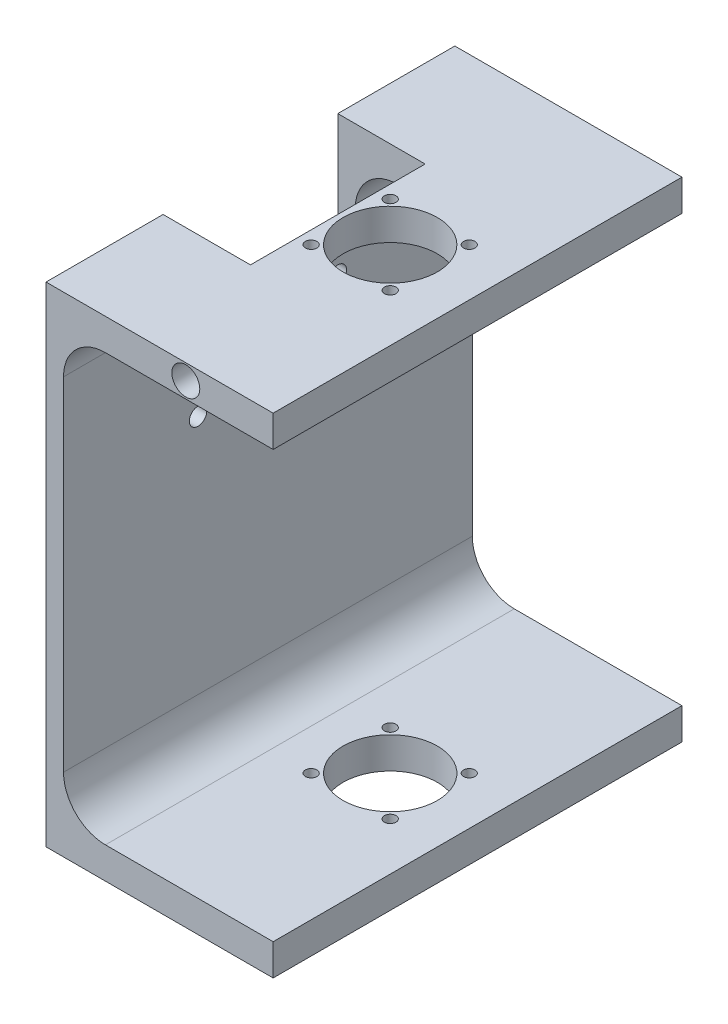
from build123d import *

# Parameters (mm, degrees)
EXTRUSION1_DEPTH          = 58.5
CONG_1_R                  = 12
ESQUISSE2_R               = 13.5
ENL_V_MAT_EXTRU_1_DEPTH   = 166.067410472
ESQUISSE4_W               = 121.645376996
ESQUISSE4_H               = 50
ENL_V_MAT_EXTRU_3_DEPTH   = 30
TROU_TARAUD_M4X0_71_D     = 3.3
TROU_TARAUD_M6X1_01_D     = 5
TROU_TARAUD_M6X1_01_DEPTH = 15
TROU_TARAUD_M6X1_01_TIP   = 1.502151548


with BuildPart() as part:
    # Esquisse1 → Extrusion1 (new, symmetric)
    with BuildSketch(Plane.XY):
        Polygon((65, -61), (65, -70), (0, -70), (0, 70), (65, 70), (65, 61), (5, 61), (5, -61), align=None)
    extrude(amount=EXTRUSION1_DEPTH, both=True)

    # Cong_1
    cong_1_edges = [part.edges().sort_by_distance(p)[0] for p in [
        (5, 61, 0),
        (5, -61, 0),
    ]]
    fillet(cong_1_edges, radius=CONG_1_R)

    # Esquisse2 → Enl_v. mat.-Extru.1 (cut, through all)
    with BuildSketch(Plane(origin=(0, 70, 0), x_dir=(-1, 0, 0), z_dir=(0, 1, 0))):
        with Locations((-40, 0)):
            Circle(ESQUISSE2_R)
    extrude(amount=-ENL_V_MAT_EXTRU_1_DEPTH, mode=Mode.SUBTRACT)

    # Esquisse4 → Enl_v. mat.-Extru.3 (cut)
    with BuildSketch(Plane(origin=(0, 70, 0), x_dir=(-1, 0, 0), z_dir=(0, 1, 0))):
        with Locations((35.822688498, 0)):
            Rectangle(ESQUISSE4_W, ESQUISSE4_H)
    extrude(amount=-ENL_V_MAT_EXTRU_3_DEPTH, mode=Mode.SUBTRACT)

    # Trou taraud_ M4x0.71 (through all)
    with Locations(Plane.XZ.offset(70)):
        with Locations((51.313708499, 11.313708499), (51.313708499, -11.313708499), (28.686291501, -11.313708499), (28.686291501, 11.313708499)):
            Hole(TROU_TARAUD_M4X0_71_D / 2)

    # Esquisse9 → Diam_tre du per_age M8.0 _8_1 (revolve, cut)
    with BuildSketch(Plane(origin=(40, 65.5, -58.5), x_dir=(0, 1, 0), z_dir=(1, 0, 0))):
        Polygon((0, 0), (0, 20.403442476), (4, 18), (4, 0), align=None)
    diam_tre_du_per_age_m8_0_8_1 = revolve(axis=Axis((40, 65.5, -64.85), (0, 0, 1)), mode=Mode.SUBTRACT)

    # Sym_trie1: Diam_tre du per_age M8.0 _8_1 across plane
    add(diam_tre_du_per_age_m8_0_8_1.mirror(Plane.XY), mode=Mode.SUBTRACT)

    # Trou taraud_ M6x1.01
    with Locations(Plane.ZY):
        with Locations((-20, 20), (-20, 35), (20, 35), (20, 20)):
            Hole(TROU_TARAUD_M6X1_01_D / 2, depth=TROU_TARAUD_M6X1_01_DEPTH)
            with Locations((0, 0, -(TROU_TARAUD_M6X1_01_DEPTH + TROU_TARAUD_M6X1_01_TIP / 2))):  # 118° drill point
                Cone(0, TROU_TARAUD_M6X1_01_D / 2, TROU_TARAUD_M6X1_01_TIP, mode=Mode.SUBTRACT)


solid = part.part
